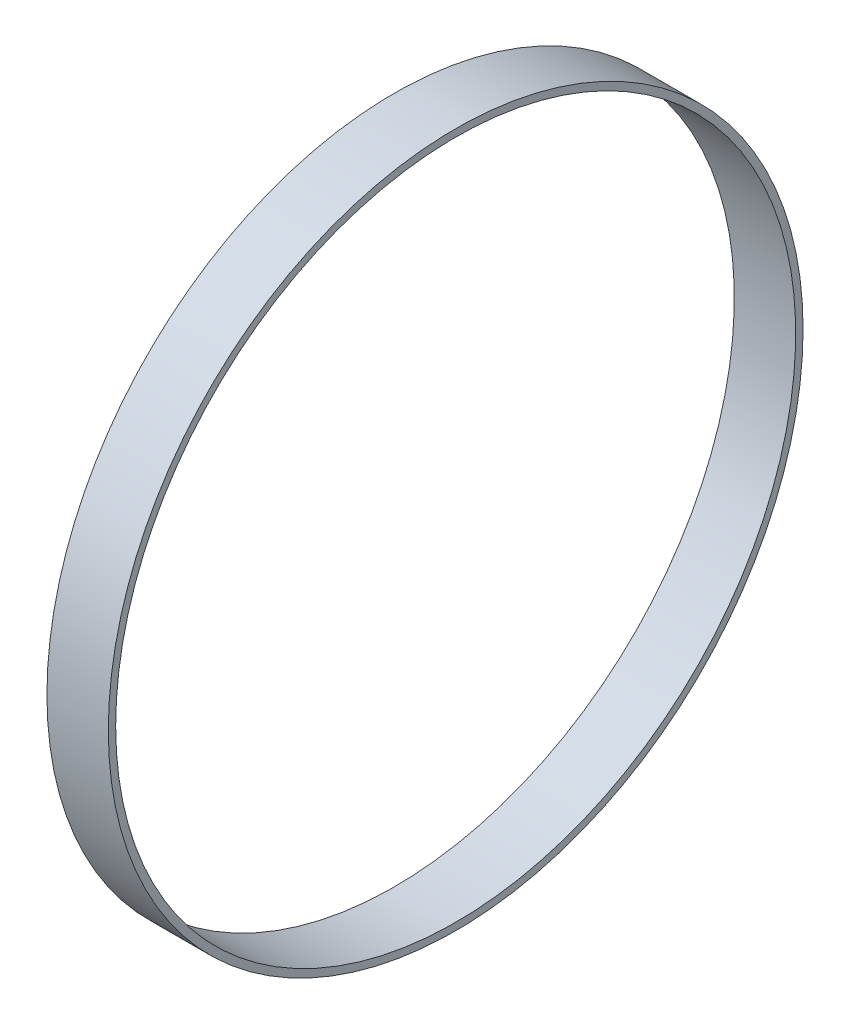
from build123d import *

# Parameters (mm, degrees)
ESQUISSE1_W = 5
ESQUISSE1_H = 0.6


with BuildPart() as part:
    # Esquisse1 → R_volution1 (revolve)
    with BuildSketch(Plane.XY, mode=Mode.PRIVATE) as r_volution1_sk:
        with Locations((0, 28)):
            Rectangle(ESQUISSE1_W, ESQUISSE1_H)
    revolve(r_volution1_sk.sketch.rotate(Axis((0, 0, 0), (1, 0, 0)), 90), axis=Axis((0, 0, 0), (1, 0, 0)))


solid = part.part
